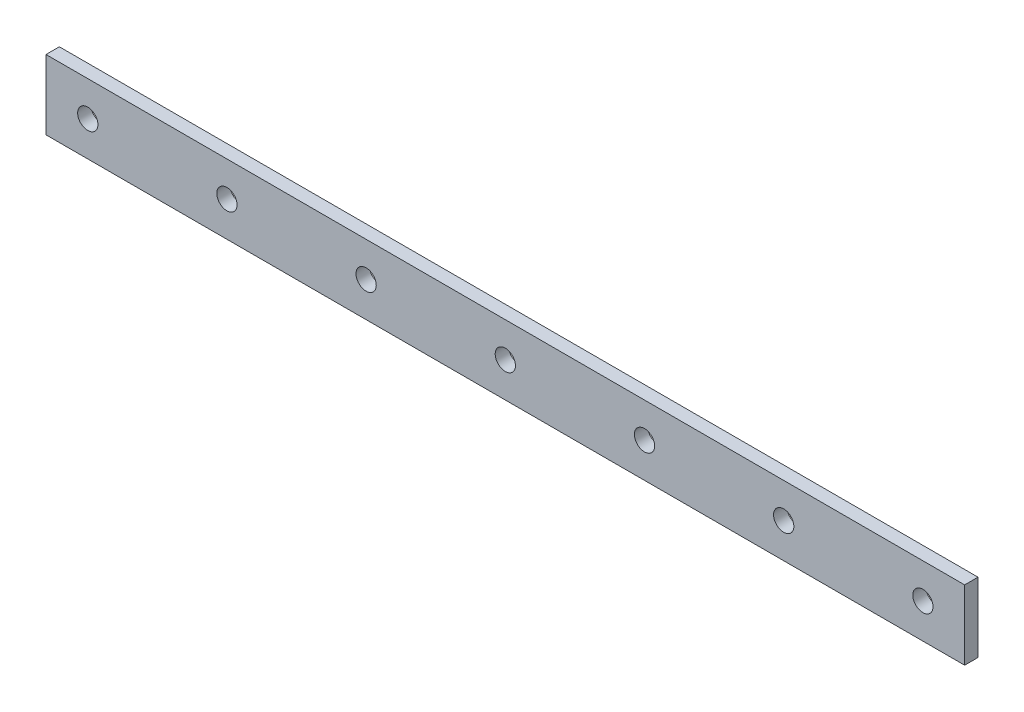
ISO-10303-21;
HEADER;
FILE_DESCRIPTION(('STEP AP214'),'2;1');
FILE_NAME('part.step','',(''),(''),'','','');
FILE_SCHEMA(('AUTOMOTIVE_DESIGN { 1 0 10303 214 1 1 1 1 }'));
ENDSEC;
DATA;
#1=APPLICATION_CONTEXT('core data for automotive mechanical design processes');
#2=APPLICATION_PROTOCOL_DEFINITION('international standard','automotive_design',2000,#1);
#3=PRODUCT_CONTEXT('',#1,'mechanical');
#4=PRODUCT('Part','Part','',(#3));
#5=PRODUCT_RELATED_PRODUCT_CATEGORY('part','',(#4));
#6=PRODUCT_DEFINITION_FORMATION('','',#4);
#7=PRODUCT_DEFINITION_CONTEXT('part definition',#1,'design');
#8=PRODUCT_DEFINITION('design','',#6,#7);
#9=PRODUCT_DEFINITION_SHAPE('','',#8);
#10=(LENGTH_UNIT() NAMED_UNIT(*) SI_UNIT(.MILLI.,.METRE.));
#11=(NAMED_UNIT(*) PLANE_ANGLE_UNIT() SI_UNIT($,.RADIAN.));
#12=(NAMED_UNIT(*) SI_UNIT($,.STERADIAN.) SOLID_ANGLE_UNIT());
#13=UNCERTAINTY_MEASURE_WITH_UNIT(LENGTH_MEASURE(1.E-05),#10,'distance_accuracy_value','');
#14=(GEOMETRIC_REPRESENTATION_CONTEXT(3) GLOBAL_UNCERTAINTY_ASSIGNED_CONTEXT((#13)) GLOBAL_UNIT_ASSIGNED_CONTEXT((#10,
#11,#12)) REPRESENTATION_CONTEXT('',''));
#15=CARTESIAN_POINT('',(0.,0.,0.));
#16=DIRECTION('',(0.,0.,1.));
#17=DIRECTION('',(1.,0.,0.));
#18=AXIS2_PLACEMENT_3D('',#15,#16,#17);
#19=CARTESIAN_POINT('',(-52.3875,-3.96875000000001,1.524));
#20=DIRECTION('',(1.,0.,0.));
#21=DIRECTION('',(0.,0.,-1.));
#22=AXIS2_PLACEMENT_3D('',#19,#20,#21);
#23=PLANE('',#22);
#24=DIRECTION('',(0.,-1.,0.));
#25=VECTOR('',#24,1.);
#26=CARTESIAN_POINT('',(-52.3875,-3.96875000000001,0.));
#27=LINE('',#26,#25);
#28=CARTESIAN_POINT('',(-52.3875,3.96874999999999,0.));
#29=VERTEX_POINT('',#28);
#30=CARTESIAN_POINT('',(-52.3875,-3.96875000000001,0.));
#31=VERTEX_POINT('',#30);
#32=EDGE_CURVE('E98',#29,#31,#27,.T.);
#33=ORIENTED_EDGE('',*,*,#32,.T.);
#34=DIRECTION('',(0.,0.,-1.));
#35=VECTOR('',#34,1.);
#36=CARTESIAN_POINT('',(-52.3875,-3.96875000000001,1.524));
#37=LINE('',#36,#35);
#38=CARTESIAN_POINT('',(-52.3875,-3.96875000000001,1.524));
#39=VERTEX_POINT('',#38);
#40=EDGE_CURVE('E11',#39,#31,#37,.T.);
#41=ORIENTED_EDGE('',*,*,#40,.F.);
#42=DIRECTION('',(0.,-1.,0.));
#43=VECTOR('',#42,1.);
#44=CARTESIAN_POINT('',(-52.3875,-3.96875000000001,1.524));
#45=LINE('',#44,#43);
#46=CARTESIAN_POINT('',(-52.3875,3.96874999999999,1.524));
#47=VERTEX_POINT('',#46);
#48=EDGE_CURVE('E86',#47,#39,#45,.T.);
#49=ORIENTED_EDGE('',*,*,#48,.F.);
#50=DIRECTION('',(0.,0.,-1.));
#51=VECTOR('',#50,1.);
#52=CARTESIAN_POINT('',(-52.3875,3.96874999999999,1.524));
#53=LINE('',#52,#51);
#54=EDGE_CURVE('E94',#47,#29,#53,.T.);
#55=ORIENTED_EDGE('',*,*,#54,.T.);
#56=EDGE_LOOP('',(#33,#41,#49,#55));
#57=FACE_BOUND('',#56,.T.);
#58=ADVANCED_FACE('F35',(#57),#23,.F.);
#59=CARTESIAN_POINT('',(52.3875,-3.96874999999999,1.524));
#60=DIRECTION('',(0.,1.,0.));
#61=DIRECTION('',(-1.,0.,0.));
#62=AXIS2_PLACEMENT_3D('',#59,#60,#61);
#63=PLANE('',#62);
#64=DIRECTION('',(1.,0.,0.));
#65=VECTOR('',#64,1.);
#66=CARTESIAN_POINT('',(52.3875,-3.96874999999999,0.));
#67=LINE('',#66,#65);
#68=CARTESIAN_POINT('',(52.3875,-3.96874999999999,0.));
#69=VERTEX_POINT('',#68);
#70=EDGE_CURVE('E90',#31,#69,#67,.T.);
#71=ORIENTED_EDGE('',*,*,#70,.T.);
#72=DIRECTION('',(0.,0.,-1.));
#73=VECTOR('',#72,1.);
#74=CARTESIAN_POINT('',(52.3875,-3.96874999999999,1.524));
#75=LINE('',#74,#73);
#76=CARTESIAN_POINT('',(52.3875,-3.96874999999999,1.524));
#77=VERTEX_POINT('',#76);
#78=EDGE_CURVE('E43',#77,#69,#75,.T.);
#79=ORIENTED_EDGE('',*,*,#78,.F.);
#80=DIRECTION('',(1.,0.,0.));
#81=VECTOR('',#80,1.);
#82=CARTESIAN_POINT('',(52.3875,-3.96874999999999,1.524));
#83=LINE('',#82,#81);
#84=EDGE_CURVE('E81',#39,#77,#83,.T.);
#85=ORIENTED_EDGE('',*,*,#84,.F.);
#86=ORIENTED_EDGE('',*,*,#40,.T.);
#87=EDGE_LOOP('',(#71,#79,#85,#86));
#88=FACE_BOUND('',#87,.T.);
#89=ADVANCED_FACE('F89',(#88),#63,.F.);
#90=CARTESIAN_POINT('',(52.3875,-3.96874999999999,1.524));
#91=DIRECTION('',(-1.,0.,0.));
#92=DIRECTION('',(0.,0.,1.));
#93=AXIS2_PLACEMENT_3D('',#90,#91,#92);
#94=PLANE('',#93);
#95=DIRECTION('',(0.,1.,0.));
#96=VECTOR('',#95,1.);
#97=CARTESIAN_POINT('',(52.3875,-3.96874999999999,0.));
#98=LINE('',#97,#96);
#99=CARTESIAN_POINT('',(52.3875,3.96875000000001,0.));
#100=VERTEX_POINT('',#99);
#101=EDGE_CURVE('E68',#69,#100,#98,.T.);
#102=ORIENTED_EDGE('',*,*,#101,.T.);
#103=DIRECTION('',(0.,0.,-1.));
#104=VECTOR('',#103,1.);
#105=CARTESIAN_POINT('',(52.3875,3.96875000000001,1.524));
#106=LINE('',#105,#104);
#107=CARTESIAN_POINT('',(52.3875,3.96875000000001,1.524));
#108=VERTEX_POINT('',#107);
#109=EDGE_CURVE('E91',#108,#100,#106,.T.);
#110=ORIENTED_EDGE('',*,*,#109,.F.);
#111=DIRECTION('',(0.,1.,0.));
#112=VECTOR('',#111,1.);
#113=CARTESIAN_POINT('',(52.3875,-3.96874999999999,1.524));
#114=LINE('',#113,#112);
#115=EDGE_CURVE('E84',#77,#108,#114,.T.);
#116=ORIENTED_EDGE('',*,*,#115,.F.);
#117=ORIENTED_EDGE('',*,*,#78,.T.);
#118=EDGE_LOOP('',(#102,#110,#116,#117));
#119=FACE_BOUND('',#118,.T.);
#120=ADVANCED_FACE('F92',(#119),#94,.F.);
#121=CARTESIAN_POINT('',(52.3875,3.96875000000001,1.524));
#122=DIRECTION('',(0.,-1.,0.));
#123=DIRECTION('',(1.,0.,0.));
#124=AXIS2_PLACEMENT_3D('',#121,#122,#123);
#125=PLANE('',#124);
#126=DIRECTION('',(-1.,0.,0.));
#127=VECTOR('',#126,1.);
#128=CARTESIAN_POINT('',(52.3875,3.96875000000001,0.));
#129=LINE('',#128,#127);
#130=EDGE_CURVE('E74',#100,#29,#129,.T.);
#131=ORIENTED_EDGE('',*,*,#130,.T.);
#132=ORIENTED_EDGE('',*,*,#54,.F.);
#133=DIRECTION('',(-1.,0.,0.));
#134=VECTOR('',#133,1.);
#135=CARTESIAN_POINT('',(52.3875,3.96875000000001,1.524));
#136=LINE('',#135,#134);
#137=EDGE_CURVE('E51',#108,#47,#136,.T.);
#138=ORIENTED_EDGE('',*,*,#137,.F.);
#139=ORIENTED_EDGE('',*,*,#109,.T.);
#140=EDGE_LOOP('',(#131,#132,#138,#139));
#141=FACE_BOUND('',#140,.T.);
#142=ADVANCED_FACE('F106',(#141),#125,.F.);
#143=CARTESIAN_POINT('',(0.,0.,1.524));
#144=DIRECTION('',(0.,0.,1.));
#145=DIRECTION('',(1.,0.,0.));
#146=AXIS2_PLACEMENT_3D('',#143,#144,#145);
#147=PLANE('',#146);
#148=CARTESIAN_POINT('',(47.625,0.,1.524));
#149=DIRECTION('',(0.,0.,1.));
#150=DIRECTION('',(1.,0.,0.));
#151=AXIS2_PLACEMENT_3D('',#148,#149,#150);
#152=CIRCLE('',#151,1.1557);
#153=CARTESIAN_POINT('',(48.7807,0.,1.524));
#154=VERTEX_POINT('',#153);
#155=EDGE_CURVE('E148',#154,#154,#152,.T.);
#156=ORIENTED_EDGE('',*,*,#155,.F.);
#157=EDGE_LOOP('',(#156));
#158=FACE_BOUND('',#157,.T.);
#159=CARTESIAN_POINT('',(31.75,0.,1.524));
#160=DIRECTION('',(0.,0.,1.));
#161=DIRECTION('',(1.,0.,0.));
#162=AXIS2_PLACEMENT_3D('',#159,#160,#161);
#163=CIRCLE('',#162,1.1557);
#164=CARTESIAN_POINT('',(32.9057,0.,1.524));
#165=VERTEX_POINT('',#164);
#166=EDGE_CURVE('E142',#165,#165,#163,.T.);
#167=ORIENTED_EDGE('',*,*,#166,.F.);
#168=EDGE_LOOP('',(#167));
#169=FACE_BOUND('',#168,.T.);
#170=CARTESIAN_POINT('',(15.875,0.,1.524));
#171=DIRECTION('',(0.,0.,1.));
#172=DIRECTION('',(1.,0.,0.));
#173=AXIS2_PLACEMENT_3D('',#170,#171,#172);
#174=CIRCLE('',#173,1.1557);
#175=CARTESIAN_POINT('',(17.0307,0.,1.524));
#176=VERTEX_POINT('',#175);
#177=EDGE_CURVE('E136',#176,#176,#174,.T.);
#178=ORIENTED_EDGE('',*,*,#177,.F.);
#179=EDGE_LOOP('',(#178));
#180=FACE_BOUND('',#179,.T.);
#181=CARTESIAN_POINT('',(-47.625,0.,1.524));
#182=DIRECTION('',(0.,0.,1.));
#183=DIRECTION('',(1.,0.,0.));
#184=AXIS2_PLACEMENT_3D('',#181,#182,#183);
#185=CIRCLE('',#184,1.1557);
#186=CARTESIAN_POINT('',(-46.4693,0.,1.524));
#187=VERTEX_POINT('',#186);
#188=EDGE_CURVE('E130',#187,#187,#185,.T.);
#189=ORIENTED_EDGE('',*,*,#188,.F.);
#190=EDGE_LOOP('',(#189));
#191=FACE_BOUND('',#190,.T.);
#192=CARTESIAN_POINT('',(-31.75,0.,1.524));
#193=DIRECTION('',(0.,0.,1.));
#194=DIRECTION('',(1.,0.,0.));
#195=AXIS2_PLACEMENT_3D('',#192,#193,#194);
#196=CIRCLE('',#195,1.1557);
#197=CARTESIAN_POINT('',(-30.5943,0.,1.524));
#198=VERTEX_POINT('',#197);
#199=EDGE_CURVE('E124',#198,#198,#196,.T.);
#200=ORIENTED_EDGE('',*,*,#199,.F.);
#201=EDGE_LOOP('',(#200));
#202=FACE_BOUND('',#201,.T.);
#203=CARTESIAN_POINT('',(-15.875,0.,1.524));
#204=DIRECTION('',(0.,0.,1.));
#205=DIRECTION('',(1.,0.,0.));
#206=AXIS2_PLACEMENT_3D('',#203,#204,#205);
#207=CIRCLE('',#206,1.1557);
#208=CARTESIAN_POINT('',(-14.7193,0.,1.524));
#209=VERTEX_POINT('',#208);
#210=EDGE_CURVE('E118',#209,#209,#207,.T.);
#211=ORIENTED_EDGE('',*,*,#210,.F.);
#212=EDGE_LOOP('',(#211));
#213=FACE_BOUND('',#212,.T.);
#214=CARTESIAN_POINT('',(0.,0.,1.524));
#215=DIRECTION('',(0.,0.,1.));
#216=DIRECTION('',(1.,0.,0.));
#217=AXIS2_PLACEMENT_3D('',#214,#215,#216);
#218=CIRCLE('',#217,1.1557);
#219=CARTESIAN_POINT('',(1.1557,0.,1.524));
#220=VERTEX_POINT('',#219);
#221=EDGE_CURVE('E112',#220,#220,#218,.T.);
#222=ORIENTED_EDGE('',*,*,#221,.F.);
#223=EDGE_LOOP('',(#222));
#224=FACE_BOUND('',#223,.T.);
#225=ORIENTED_EDGE('',*,*,#48,.T.);
#226=ORIENTED_EDGE('',*,*,#84,.T.);
#227=ORIENTED_EDGE('',*,*,#115,.T.);
#228=ORIENTED_EDGE('',*,*,#137,.T.);
#229=EDGE_LOOP('',(#225,#226,#227,#228));
#230=FACE_BOUND('',#229,.T.);
#231=ADVANCED_FACE('F82',(#158,#169,#180,#191,#202,#213,#224,#230),#147,.T.);
#232=CARTESIAN_POINT('',(0.,0.,0.));
#233=DIRECTION('',(0.,0.,1.));
#234=DIRECTION('',(1.,0.,0.));
#235=AXIS2_PLACEMENT_3D('',#232,#233,#234);
#236=PLANE('',#235);
#237=CARTESIAN_POINT('',(47.625,0.,0.));
#238=DIRECTION('',(0.,0.,1.));
#239=DIRECTION('',(1.,0.,0.));
#240=AXIS2_PLACEMENT_3D('',#237,#238,#239);
#241=CIRCLE('',#240,1.1557);
#242=CARTESIAN_POINT('',(48.7807,0.,0.));
#243=VERTEX_POINT('',#242);
#244=EDGE_CURVE('E145',#243,#243,#241,.T.);
#245=ORIENTED_EDGE('',*,*,#244,.T.);
#246=EDGE_LOOP('',(#245));
#247=FACE_BOUND('',#246,.T.);
#248=CARTESIAN_POINT('',(31.75,0.,0.));
#249=DIRECTION('',(0.,0.,1.));
#250=DIRECTION('',(1.,0.,0.));
#251=AXIS2_PLACEMENT_3D('',#248,#249,#250);
#252=CIRCLE('',#251,1.1557);
#253=CARTESIAN_POINT('',(32.9057,0.,0.));
#254=VERTEX_POINT('',#253);
#255=EDGE_CURVE('E139',#254,#254,#252,.T.);
#256=ORIENTED_EDGE('',*,*,#255,.T.);
#257=EDGE_LOOP('',(#256));
#258=FACE_BOUND('',#257,.T.);
#259=CARTESIAN_POINT('',(15.875,0.,0.));
#260=DIRECTION('',(0.,0.,1.));
#261=DIRECTION('',(1.,0.,0.));
#262=AXIS2_PLACEMENT_3D('',#259,#260,#261);
#263=CIRCLE('',#262,1.1557);
#264=CARTESIAN_POINT('',(17.0307,0.,0.));
#265=VERTEX_POINT('',#264);
#266=EDGE_CURVE('E133',#265,#265,#263,.T.);
#267=ORIENTED_EDGE('',*,*,#266,.T.);
#268=EDGE_LOOP('',(#267));
#269=FACE_BOUND('',#268,.T.);
#270=CARTESIAN_POINT('',(-47.625,0.,0.));
#271=DIRECTION('',(0.,0.,1.));
#272=DIRECTION('',(1.,0.,0.));
#273=AXIS2_PLACEMENT_3D('',#270,#271,#272);
#274=CIRCLE('',#273,1.1557);
#275=CARTESIAN_POINT('',(-46.4693,0.,0.));
#276=VERTEX_POINT('',#275);
#277=EDGE_CURVE('E127',#276,#276,#274,.T.);
#278=ORIENTED_EDGE('',*,*,#277,.T.);
#279=EDGE_LOOP('',(#278));
#280=FACE_BOUND('',#279,.T.);
#281=CARTESIAN_POINT('',(-31.75,0.,0.));
#282=DIRECTION('',(0.,0.,1.));
#283=DIRECTION('',(1.,0.,0.));
#284=AXIS2_PLACEMENT_3D('',#281,#282,#283);
#285=CIRCLE('',#284,1.1557);
#286=CARTESIAN_POINT('',(-30.5943,0.,0.));
#287=VERTEX_POINT('',#286);
#288=EDGE_CURVE('E121',#287,#287,#285,.T.);
#289=ORIENTED_EDGE('',*,*,#288,.T.);
#290=EDGE_LOOP('',(#289));
#291=FACE_BOUND('',#290,.T.);
#292=CARTESIAN_POINT('',(-15.875,0.,0.));
#293=DIRECTION('',(0.,0.,1.));
#294=DIRECTION('',(1.,0.,0.));
#295=AXIS2_PLACEMENT_3D('',#292,#293,#294);
#296=CIRCLE('',#295,1.1557);
#297=CARTESIAN_POINT('',(-14.7193,0.,0.));
#298=VERTEX_POINT('',#297);
#299=EDGE_CURVE('E115',#298,#298,#296,.T.);
#300=ORIENTED_EDGE('',*,*,#299,.T.);
#301=EDGE_LOOP('',(#300));
#302=FACE_BOUND('',#301,.T.);
#303=CARTESIAN_POINT('',(0.,0.,0.));
#304=DIRECTION('',(0.,0.,1.));
#305=DIRECTION('',(1.,0.,0.));
#306=AXIS2_PLACEMENT_3D('',#303,#304,#305);
#307=CIRCLE('',#306,1.1557);
#308=CARTESIAN_POINT('',(1.1557,0.,0.));
#309=VERTEX_POINT('',#308);
#310=EDGE_CURVE('E101',#309,#309,#307,.T.);
#311=ORIENTED_EDGE('',*,*,#310,.T.);
#312=EDGE_LOOP('',(#311));
#313=FACE_BOUND('',#312,.T.);
#314=ORIENTED_EDGE('',*,*,#32,.F.);
#315=ORIENTED_EDGE('',*,*,#130,.F.);
#316=ORIENTED_EDGE('',*,*,#101,.F.);
#317=ORIENTED_EDGE('',*,*,#70,.F.);
#318=EDGE_LOOP('',(#314,#315,#316,#317));
#319=FACE_BOUND('',#318,.T.);
#320=ADVANCED_FACE('F109',(#247,#258,#269,#280,#291,#302,#313,#319),#236,.F.);
#321=CARTESIAN_POINT('',(0.,0.,0.));
#322=DIRECTION('',(0.,0.,1.));
#323=DIRECTION('',(1.,0.,0.));
#324=AXIS2_PLACEMENT_3D('',#321,#322,#323);
#325=CYLINDRICAL_SURFACE('',#324,1.1557);
#326=CARTESIAN_POINT('',(1.1557,0.,0.));
#327=CARTESIAN_POINT('',(1.1557,0.,0.015875));
#328=CARTESIAN_POINT('',(1.1557,0.,0.03175));
#329=CARTESIAN_POINT('',(1.1557,0.,0.0635));
#330=CARTESIAN_POINT('',(1.1557,0.,0.079375));
#331=CARTESIAN_POINT('',(1.1557,0.,0.111125));
#332=CARTESIAN_POINT('',(1.1557,0.,0.127));
#333=CARTESIAN_POINT('',(1.1557,0.,0.15875));
#334=CARTESIAN_POINT('',(1.1557,0.,0.174625));
#335=CARTESIAN_POINT('',(1.1557,0.,0.206375));
#336=CARTESIAN_POINT('',(1.1557,0.,0.22225));
#337=CARTESIAN_POINT('',(1.1557,0.,0.254));
#338=CARTESIAN_POINT('',(1.1557,0.,0.269875));
#339=CARTESIAN_POINT('',(1.1557,0.,0.301625));
#340=CARTESIAN_POINT('',(1.1557,0.,0.3175));
#341=CARTESIAN_POINT('',(1.1557,0.,0.34925));
#342=CARTESIAN_POINT('',(1.1557,0.,0.365125));
#343=CARTESIAN_POINT('',(1.1557,0.,0.396875));
#344=CARTESIAN_POINT('',(1.1557,0.,0.41275));
#345=CARTESIAN_POINT('',(1.1557,0.,0.4445));
#346=CARTESIAN_POINT('',(1.1557,0.,0.460375));
#347=CARTESIAN_POINT('',(1.1557,0.,0.492125));
#348=CARTESIAN_POINT('',(1.1557,0.,0.508));
#349=CARTESIAN_POINT('',(1.1557,0.,0.53975));
#350=CARTESIAN_POINT('',(1.1557,0.,0.555625));
#351=CARTESIAN_POINT('',(1.1557,0.,0.587375));
#352=CARTESIAN_POINT('',(1.1557,0.,0.60325));
#353=CARTESIAN_POINT('',(1.1557,0.,0.635));
#354=CARTESIAN_POINT('',(1.1557,0.,0.650875));
#355=CARTESIAN_POINT('',(1.1557,0.,0.682625));
#356=CARTESIAN_POINT('',(1.1557,0.,0.6985));
#357=CARTESIAN_POINT('',(1.1557,0.,0.73025));
#358=CARTESIAN_POINT('',(1.1557,0.,0.746125));
#359=CARTESIAN_POINT('',(1.1557,0.,0.777875));
#360=CARTESIAN_POINT('',(1.1557,0.,0.79375));
#361=CARTESIAN_POINT('',(1.1557,0.,0.8255));
#362=CARTESIAN_POINT('',(1.1557,0.,0.841375));
#363=CARTESIAN_POINT('',(1.1557,0.,0.873125));
#364=CARTESIAN_POINT('',(1.1557,0.,0.889));
#365=CARTESIAN_POINT('',(1.1557,0.,0.92075));
#366=CARTESIAN_POINT('',(1.1557,0.,0.936625));
#367=CARTESIAN_POINT('',(1.1557,0.,0.968375));
#368=CARTESIAN_POINT('',(1.1557,0.,0.98425));
#369=CARTESIAN_POINT('',(1.1557,0.,1.016));
#370=CARTESIAN_POINT('',(1.1557,0.,1.031875));
#371=CARTESIAN_POINT('',(1.1557,0.,1.063625));
#372=CARTESIAN_POINT('',(1.1557,0.,1.0795));
#373=CARTESIAN_POINT('',(1.1557,0.,1.11125));
#374=CARTESIAN_POINT('',(1.1557,0.,1.127125));
#375=CARTESIAN_POINT('',(1.1557,0.,1.158875));
#376=CARTESIAN_POINT('',(1.1557,0.,1.17475));
#377=CARTESIAN_POINT('',(1.1557,0.,1.2065));
#378=CARTESIAN_POINT('',(1.1557,0.,1.222375));
#379=CARTESIAN_POINT('',(1.1557,0.,1.254125));
#380=CARTESIAN_POINT('',(1.1557,0.,1.27));
#381=CARTESIAN_POINT('',(1.1557,0.,1.30175));
#382=CARTESIAN_POINT('',(1.1557,0.,1.317625));
#383=CARTESIAN_POINT('',(1.1557,0.,1.349375));
#384=CARTESIAN_POINT('',(1.1557,0.,1.36525));
#385=CARTESIAN_POINT('',(1.1557,0.,1.397));
#386=CARTESIAN_POINT('',(1.1557,0.,1.412875));
#387=CARTESIAN_POINT('',(1.1557,0.,1.444625));
#388=CARTESIAN_POINT('',(1.1557,0.,1.4605));
#389=CARTESIAN_POINT('',(1.1557,0.,1.49225));
#390=CARTESIAN_POINT('',(1.1557,0.,1.508125));
#391=CARTESIAN_POINT('',(1.1557,0.,1.524));
#392=B_SPLINE_CURVE_WITH_KNOTS('',3,(#326,#327,#328,#329,#330,#331,#332,#333,#334,#335,#336,
#337,#338,#339,#340,#341,#342,#343,#344,#345,#346,#347,#348,#349,#350,#351,#352,#353,#354,#355,
#356,#357,#358,#359,#360,#361,#362,#363,#364,#365,#366,#367,#368,#369,#370,#371,#372,#373,#374,
#375,#376,#377,#378,#379,#380,#381,#382,#383,#384,#385,#386,#387,#388,#389,#390,#391),
.UNSPECIFIED.,.F.,.F.,(4,2,2,2,2,2,2,2,2,2,2,2,2,2,2,2,2,2,2,2,2,2,2,2,2,2,2,2,2,2,2,2,4),(0.,
0.047625,0.09525,0.142875,0.1905,0.238125,0.28575,0.333375,0.381,0.428625,0.47625,0.523875,
0.5715,0.619125,0.66675,0.714375,0.762,0.809625,0.85725,0.904875,0.9525,1.000125,1.04775,
1.095375,1.143,1.190625,1.23825,1.285875,1.3335,1.381125,1.42875,1.476375,1.524),.UNSPECIFIED.);
#393=EDGE_CURVE('BSEAM178',#309,#220,#392,.T.);
#394=ORIENTED_EDGE('',*,*,#310,.F.);
#395=ORIENTED_EDGE('',*,*,#221,.T.);
#396=ORIENTED_EDGE('',*,*,#393,.T.);
#397=ORIENTED_EDGE('',*,*,#393,.F.);
#398=EDGE_LOOP('',(#394,#396,#395,#397));
#399=FACE_BOUND('',#398,.T.);
#400=ADVANCED_FACE('F178',(#399),#325,.F.);
#401=CARTESIAN_POINT('',(-15.875,0.,0.));
#402=DIRECTION('',(0.,0.,1.));
#403=DIRECTION('',(1.,0.,0.));
#404=AXIS2_PLACEMENT_3D('',#401,#402,#403);
#405=CYLINDRICAL_SURFACE('',#404,1.1557);
#406=CARTESIAN_POINT('',(-14.7193,0.,0.));
#407=CARTESIAN_POINT('',(-14.7193,0.,0.015875));
#408=CARTESIAN_POINT('',(-14.7193,0.,0.03175));
#409=CARTESIAN_POINT('',(-14.7193,0.,0.0635));
#410=CARTESIAN_POINT('',(-14.7193,0.,0.079375));
#411=CARTESIAN_POINT('',(-14.7193,0.,0.111125));
#412=CARTESIAN_POINT('',(-14.7193,0.,0.127));
#413=CARTESIAN_POINT('',(-14.7193,0.,0.15875));
#414=CARTESIAN_POINT('',(-14.7193,0.,0.174625));
#415=CARTESIAN_POINT('',(-14.7193,0.,0.206375));
#416=CARTESIAN_POINT('',(-14.7193,0.,0.22225));
#417=CARTESIAN_POINT('',(-14.7193,0.,0.254));
#418=CARTESIAN_POINT('',(-14.7193,0.,0.269875));
#419=CARTESIAN_POINT('',(-14.7193,0.,0.301625));
#420=CARTESIAN_POINT('',(-14.7193,0.,0.3175));
#421=CARTESIAN_POINT('',(-14.7193,0.,0.34925));
#422=CARTESIAN_POINT('',(-14.7193,0.,0.365125));
#423=CARTESIAN_POINT('',(-14.7193,0.,0.396875));
#424=CARTESIAN_POINT('',(-14.7193,0.,0.41275));
#425=CARTESIAN_POINT('',(-14.7193,0.,0.4445));
#426=CARTESIAN_POINT('',(-14.7193,0.,0.460375));
#427=CARTESIAN_POINT('',(-14.7193,0.,0.492125));
#428=CARTESIAN_POINT('',(-14.7193,0.,0.508));
#429=CARTESIAN_POINT('',(-14.7193,0.,0.53975));
#430=CARTESIAN_POINT('',(-14.7193,0.,0.555625));
#431=CARTESIAN_POINT('',(-14.7193,0.,0.587375));
#432=CARTESIAN_POINT('',(-14.7193,0.,0.60325));
#433=CARTESIAN_POINT('',(-14.7193,0.,0.635));
#434=CARTESIAN_POINT('',(-14.7193,0.,0.650875));
#435=CARTESIAN_POINT('',(-14.7193,0.,0.682625));
#436=CARTESIAN_POINT('',(-14.7193,0.,0.6985));
#437=CARTESIAN_POINT('',(-14.7193,0.,0.73025));
#438=CARTESIAN_POINT('',(-14.7193,0.,0.746125));
#439=CARTESIAN_POINT('',(-14.7193,0.,0.777875));
#440=CARTESIAN_POINT('',(-14.7193,0.,0.79375));
#441=CARTESIAN_POINT('',(-14.7193,0.,0.8255));
#442=CARTESIAN_POINT('',(-14.7193,0.,0.841375));
#443=CARTESIAN_POINT('',(-14.7193,0.,0.873125));
#444=CARTESIAN_POINT('',(-14.7193,0.,0.889));
#445=CARTESIAN_POINT('',(-14.7193,0.,0.92075));
#446=CARTESIAN_POINT('',(-14.7193,0.,0.936625));
#447=CARTESIAN_POINT('',(-14.7193,0.,0.968375));
#448=CARTESIAN_POINT('',(-14.7193,0.,0.98425));
#449=CARTESIAN_POINT('',(-14.7193,0.,1.016));
#450=CARTESIAN_POINT('',(-14.7193,0.,1.031875));
#451=CARTESIAN_POINT('',(-14.7193,0.,1.063625));
#452=CARTESIAN_POINT('',(-14.7193,0.,1.0795));
#453=CARTESIAN_POINT('',(-14.7193,0.,1.11125));
#454=CARTESIAN_POINT('',(-14.7193,0.,1.127125));
#455=CARTESIAN_POINT('',(-14.7193,0.,1.158875));
#456=CARTESIAN_POINT('',(-14.7193,0.,1.17475));
#457=CARTESIAN_POINT('',(-14.7193,0.,1.2065));
#458=CARTESIAN_POINT('',(-14.7193,0.,1.222375));
#459=CARTESIAN_POINT('',(-14.7193,0.,1.254125));
#460=CARTESIAN_POINT('',(-14.7193,0.,1.27));
#461=CARTESIAN_POINT('',(-14.7193,0.,1.30175));
#462=CARTESIAN_POINT('',(-14.7193,0.,1.317625));
#463=CARTESIAN_POINT('',(-14.7193,0.,1.349375));
#464=CARTESIAN_POINT('',(-14.7193,0.,1.36525));
#465=CARTESIAN_POINT('',(-14.7193,0.,1.397));
#466=CARTESIAN_POINT('',(-14.7193,0.,1.412875));
#467=CARTESIAN_POINT('',(-14.7193,0.,1.444625));
#468=CARTESIAN_POINT('',(-14.7193,0.,1.4605));
#469=CARTESIAN_POINT('',(-14.7193,0.,1.49225));
#470=CARTESIAN_POINT('',(-14.7193,0.,1.508125));
#471=CARTESIAN_POINT('',(-14.7193,0.,1.524));
#472=B_SPLINE_CURVE_WITH_KNOTS('',3,(#406,#407,#408,#409,#410,#411,#412,#413,#414,#415,#416,
#417,#418,#419,#420,#421,#422,#423,#424,#425,#426,#427,#428,#429,#430,#431,#432,#433,#434,#435,
#436,#437,#438,#439,#440,#441,#442,#443,#444,#445,#446,#447,#448,#449,#450,#451,#452,#453,#454,
#455,#456,#457,#458,#459,#460,#461,#462,#463,#464,#465,#466,#467,#468,#469,#470,#471),
.UNSPECIFIED.,.F.,.F.,(4,2,2,2,2,2,2,2,2,2,2,2,2,2,2,2,2,2,2,2,2,2,2,2,2,2,2,2,2,2,2,2,4),(0.,
0.047625,0.09525,0.142875,0.1905,0.238125,0.28575,0.333375,0.381,0.428625,0.47625,0.523875,
0.5715,0.619125,0.66675,0.714375,0.762,0.809625,0.85725,0.904875,0.9525,1.000125,1.04775,
1.095375,1.143,1.190625,1.23825,1.285875,1.3335,1.381125,1.42875,1.476375,1.524),.UNSPECIFIED.);
#473=EDGE_CURVE('BSEAM180',#298,#209,#472,.T.);
#474=ORIENTED_EDGE('',*,*,#299,.F.);
#475=ORIENTED_EDGE('',*,*,#210,.T.);
#476=ORIENTED_EDGE('',*,*,#473,.T.);
#477=ORIENTED_EDGE('',*,*,#473,.F.);
#478=EDGE_LOOP('',(#474,#476,#475,#477));
#479=FACE_BOUND('',#478,.T.);
#480=ADVANCED_FACE('F180',(#479),#405,.F.);
#481=CARTESIAN_POINT('',(-31.75,0.,0.));
#482=DIRECTION('',(0.,0.,1.));
#483=DIRECTION('',(1.,0.,0.));
#484=AXIS2_PLACEMENT_3D('',#481,#482,#483);
#485=CYLINDRICAL_SURFACE('',#484,1.1557);
#486=CARTESIAN_POINT('',(-30.5943,0.,0.));
#487=CARTESIAN_POINT('',(-30.5943,0.,0.015875));
#488=CARTESIAN_POINT('',(-30.5943,0.,0.03175));
#489=CARTESIAN_POINT('',(-30.5943,0.,0.0635));
#490=CARTESIAN_POINT('',(-30.5943,0.,0.079375));
#491=CARTESIAN_POINT('',(-30.5943,0.,0.111125));
#492=CARTESIAN_POINT('',(-30.5943,0.,0.127));
#493=CARTESIAN_POINT('',(-30.5943,0.,0.15875));
#494=CARTESIAN_POINT('',(-30.5943,0.,0.174625));
#495=CARTESIAN_POINT('',(-30.5943,0.,0.206375));
#496=CARTESIAN_POINT('',(-30.5943,0.,0.22225));
#497=CARTESIAN_POINT('',(-30.5943,0.,0.254));
#498=CARTESIAN_POINT('',(-30.5943,0.,0.269875));
#499=CARTESIAN_POINT('',(-30.5943,0.,0.301625));
#500=CARTESIAN_POINT('',(-30.5943,0.,0.3175));
#501=CARTESIAN_POINT('',(-30.5943,0.,0.34925));
#502=CARTESIAN_POINT('',(-30.5943,0.,0.365125));
#503=CARTESIAN_POINT('',(-30.5943,0.,0.396875));
#504=CARTESIAN_POINT('',(-30.5943,0.,0.41275));
#505=CARTESIAN_POINT('',(-30.5943,0.,0.4445));
#506=CARTESIAN_POINT('',(-30.5943,0.,0.460375));
#507=CARTESIAN_POINT('',(-30.5943,0.,0.492125));
#508=CARTESIAN_POINT('',(-30.5943,0.,0.508));
#509=CARTESIAN_POINT('',(-30.5943,0.,0.53975));
#510=CARTESIAN_POINT('',(-30.5943,0.,0.555625));
#511=CARTESIAN_POINT('',(-30.5943,0.,0.587375));
#512=CARTESIAN_POINT('',(-30.5943,0.,0.60325));
#513=CARTESIAN_POINT('',(-30.5943,0.,0.635));
#514=CARTESIAN_POINT('',(-30.5943,0.,0.650875));
#515=CARTESIAN_POINT('',(-30.5943,0.,0.682625));
#516=CARTESIAN_POINT('',(-30.5943,0.,0.6985));
#517=CARTESIAN_POINT('',(-30.5943,0.,0.73025));
#518=CARTESIAN_POINT('',(-30.5943,0.,0.746125));
#519=CARTESIAN_POINT('',(-30.5943,0.,0.777875));
#520=CARTESIAN_POINT('',(-30.5943,0.,0.79375));
#521=CARTESIAN_POINT('',(-30.5943,0.,0.8255));
#522=CARTESIAN_POINT('',(-30.5943,0.,0.841375));
#523=CARTESIAN_POINT('',(-30.5943,0.,0.873125));
#524=CARTESIAN_POINT('',(-30.5943,0.,0.889));
#525=CARTESIAN_POINT('',(-30.5943,0.,0.92075));
#526=CARTESIAN_POINT('',(-30.5943,0.,0.936625));
#527=CARTESIAN_POINT('',(-30.5943,0.,0.968375));
#528=CARTESIAN_POINT('',(-30.5943,0.,0.98425));
#529=CARTESIAN_POINT('',(-30.5943,0.,1.016));
#530=CARTESIAN_POINT('',(-30.5943,0.,1.031875));
#531=CARTESIAN_POINT('',(-30.5943,0.,1.063625));
#532=CARTESIAN_POINT('',(-30.5943,0.,1.0795));
#533=CARTESIAN_POINT('',(-30.5943,0.,1.11125));
#534=CARTESIAN_POINT('',(-30.5943,0.,1.127125));
#535=CARTESIAN_POINT('',(-30.5943,0.,1.158875));
#536=CARTESIAN_POINT('',(-30.5943,0.,1.17475));
#537=CARTESIAN_POINT('',(-30.5943,0.,1.2065));
#538=CARTESIAN_POINT('',(-30.5943,0.,1.222375));
#539=CARTESIAN_POINT('',(-30.5943,0.,1.254125));
#540=CARTESIAN_POINT('',(-30.5943,0.,1.27));
#541=CARTESIAN_POINT('',(-30.5943,0.,1.30175));
#542=CARTESIAN_POINT('',(-30.5943,0.,1.317625));
#543=CARTESIAN_POINT('',(-30.5943,0.,1.349375));
#544=CARTESIAN_POINT('',(-30.5943,0.,1.36525));
#545=CARTESIAN_POINT('',(-30.5943,0.,1.397));
#546=CARTESIAN_POINT('',(-30.5943,0.,1.412875));
#547=CARTESIAN_POINT('',(-30.5943,0.,1.444625));
#548=CARTESIAN_POINT('',(-30.5943,0.,1.4605));
#549=CARTESIAN_POINT('',(-30.5943,0.,1.49225));
#550=CARTESIAN_POINT('',(-30.5943,0.,1.508125));
#551=CARTESIAN_POINT('',(-30.5943,0.,1.524));
#552=B_SPLINE_CURVE_WITH_KNOTS('',3,(#486,#487,#488,#489,#490,#491,#492,#493,#494,#495,#496,
#497,#498,#499,#500,#501,#502,#503,#504,#505,#506,#507,#508,#509,#510,#511,#512,#513,#514,#515,
#516,#517,#518,#519,#520,#521,#522,#523,#524,#525,#526,#527,#528,#529,#530,#531,#532,#533,#534,
#535,#536,#537,#538,#539,#540,#541,#542,#543,#544,#545,#546,#547,#548,#549,#550,#551),
.UNSPECIFIED.,.F.,.F.,(4,2,2,2,2,2,2,2,2,2,2,2,2,2,2,2,2,2,2,2,2,2,2,2,2,2,2,2,2,2,2,2,4),(0.,
0.047625,0.09525,0.142875,0.1905,0.238125,0.28575,0.333375,0.381,0.428625,0.47625,0.523875,
0.5715,0.619125,0.66675,0.714375,0.762,0.809625,0.85725,0.904875,0.9525,1.000125,1.04775,
1.095375,1.143,1.190625,1.23825,1.285875,1.3335,1.381125,1.42875,1.476375,1.524),.UNSPECIFIED.);
#553=EDGE_CURVE('BSEAM187',#287,#198,#552,.T.);
#554=ORIENTED_EDGE('',*,*,#288,.F.);
#555=ORIENTED_EDGE('',*,*,#199,.T.);
#556=ORIENTED_EDGE('',*,*,#553,.T.);
#557=ORIENTED_EDGE('',*,*,#553,.F.);
#558=EDGE_LOOP('',(#554,#556,#555,#557));
#559=FACE_BOUND('',#558,.T.);
#560=ADVANCED_FACE('F187',(#559),#485,.F.);
#561=CARTESIAN_POINT('',(-47.625,0.,0.));
#562=DIRECTION('',(0.,0.,1.));
#563=DIRECTION('',(1.,0.,0.));
#564=AXIS2_PLACEMENT_3D('',#561,#562,#563);
#565=CYLINDRICAL_SURFACE('',#564,1.1557);
#566=CARTESIAN_POINT('',(-46.4693,0.,0.));
#567=CARTESIAN_POINT('',(-46.4693,0.,0.015875));
#568=CARTESIAN_POINT('',(-46.4693,0.,0.03175));
#569=CARTESIAN_POINT('',(-46.4693,0.,0.0635));
#570=CARTESIAN_POINT('',(-46.4693,0.,0.079375));
#571=CARTESIAN_POINT('',(-46.4693,0.,0.111125));
#572=CARTESIAN_POINT('',(-46.4693,0.,0.127));
#573=CARTESIAN_POINT('',(-46.4693,0.,0.15875));
#574=CARTESIAN_POINT('',(-46.4693,0.,0.174625));
#575=CARTESIAN_POINT('',(-46.4693,0.,0.206375));
#576=CARTESIAN_POINT('',(-46.4693,0.,0.22225));
#577=CARTESIAN_POINT('',(-46.4693,0.,0.254));
#578=CARTESIAN_POINT('',(-46.4693,0.,0.269875));
#579=CARTESIAN_POINT('',(-46.4693,0.,0.301625));
#580=CARTESIAN_POINT('',(-46.4693,0.,0.3175));
#581=CARTESIAN_POINT('',(-46.4693,0.,0.34925));
#582=CARTESIAN_POINT('',(-46.4693,0.,0.365125));
#583=CARTESIAN_POINT('',(-46.4693,0.,0.396875));
#584=CARTESIAN_POINT('',(-46.4693,0.,0.41275));
#585=CARTESIAN_POINT('',(-46.4693,0.,0.4445));
#586=CARTESIAN_POINT('',(-46.4693,0.,0.460375));
#587=CARTESIAN_POINT('',(-46.4693,0.,0.492125));
#588=CARTESIAN_POINT('',(-46.4693,0.,0.508));
#589=CARTESIAN_POINT('',(-46.4693,0.,0.53975));
#590=CARTESIAN_POINT('',(-46.4693,0.,0.555625));
#591=CARTESIAN_POINT('',(-46.4693,0.,0.587375));
#592=CARTESIAN_POINT('',(-46.4693,0.,0.60325));
#593=CARTESIAN_POINT('',(-46.4693,0.,0.635));
#594=CARTESIAN_POINT('',(-46.4693,0.,0.650875));
#595=CARTESIAN_POINT('',(-46.4693,0.,0.682625));
#596=CARTESIAN_POINT('',(-46.4693,0.,0.6985));
#597=CARTESIAN_POINT('',(-46.4693,0.,0.73025));
#598=CARTESIAN_POINT('',(-46.4693,0.,0.746125));
#599=CARTESIAN_POINT('',(-46.4693,0.,0.777875));
#600=CARTESIAN_POINT('',(-46.4693,0.,0.79375));
#601=CARTESIAN_POINT('',(-46.4693,0.,0.8255));
#602=CARTESIAN_POINT('',(-46.4693,0.,0.841375));
#603=CARTESIAN_POINT('',(-46.4693,0.,0.873125));
#604=CARTESIAN_POINT('',(-46.4693,0.,0.889));
#605=CARTESIAN_POINT('',(-46.4693,0.,0.92075));
#606=CARTESIAN_POINT('',(-46.4693,0.,0.936625));
#607=CARTESIAN_POINT('',(-46.4693,0.,0.968375));
#608=CARTESIAN_POINT('',(-46.4693,0.,0.98425));
#609=CARTESIAN_POINT('',(-46.4693,0.,1.016));
#610=CARTESIAN_POINT('',(-46.4693,0.,1.031875));
#611=CARTESIAN_POINT('',(-46.4693,0.,1.063625));
#612=CARTESIAN_POINT('',(-46.4693,0.,1.0795));
#613=CARTESIAN_POINT('',(-46.4693,0.,1.11125));
#614=CARTESIAN_POINT('',(-46.4693,0.,1.127125));
#615=CARTESIAN_POINT('',(-46.4693,0.,1.158875));
#616=CARTESIAN_POINT('',(-46.4693,0.,1.17475));
#617=CARTESIAN_POINT('',(-46.4693,0.,1.2065));
#618=CARTESIAN_POINT('',(-46.4693,0.,1.222375));
#619=CARTESIAN_POINT('',(-46.4693,0.,1.254125));
#620=CARTESIAN_POINT('',(-46.4693,0.,1.27));
#621=CARTESIAN_POINT('',(-46.4693,0.,1.30175));
#622=CARTESIAN_POINT('',(-46.4693,0.,1.317625));
#623=CARTESIAN_POINT('',(-46.4693,0.,1.349375));
#624=CARTESIAN_POINT('',(-46.4693,0.,1.36525));
#625=CARTESIAN_POINT('',(-46.4693,0.,1.397));
#626=CARTESIAN_POINT('',(-46.4693,0.,1.412875));
#627=CARTESIAN_POINT('',(-46.4693,0.,1.444625));
#628=CARTESIAN_POINT('',(-46.4693,0.,1.4605));
#629=CARTESIAN_POINT('',(-46.4693,0.,1.49225));
#630=CARTESIAN_POINT('',(-46.4693,0.,1.508125));
#631=CARTESIAN_POINT('',(-46.4693,0.,1.524));
#632=B_SPLINE_CURVE_WITH_KNOTS('',3,(#566,#567,#568,#569,#570,#571,#572,#573,#574,#575,#576,
#577,#578,#579,#580,#581,#582,#583,#584,#585,#586,#587,#588,#589,#590,#591,#592,#593,#594,#595,
#596,#597,#598,#599,#600,#601,#602,#603,#604,#605,#606,#607,#608,#609,#610,#611,#612,#613,#614,
#615,#616,#617,#618,#619,#620,#621,#622,#623,#624,#625,#626,#627,#628,#629,#630,#631),
.UNSPECIFIED.,.F.,.F.,(4,2,2,2,2,2,2,2,2,2,2,2,2,2,2,2,2,2,2,2,2,2,2,2,2,2,2,2,2,2,2,2,4),(0.,
0.047625,0.09525,0.142875,0.1905,0.238125,0.28575,0.333375,0.381,0.428625,0.47625,0.523875,
0.5715,0.619125,0.66675,0.714375,0.762,0.809625,0.85725,0.904875,0.9525,1.000125,1.04775,
1.095375,1.143,1.190625,1.23825,1.285875,1.3335,1.381125,1.42875,1.476375,1.524),.UNSPECIFIED.);
#633=EDGE_CURVE('BSEAM230',#276,#187,#632,.T.);
#634=ORIENTED_EDGE('',*,*,#277,.F.);
#635=ORIENTED_EDGE('',*,*,#188,.T.);
#636=ORIENTED_EDGE('',*,*,#633,.T.);
#637=ORIENTED_EDGE('',*,*,#633,.F.);
#638=EDGE_LOOP('',(#634,#636,#635,#637));
#639=FACE_BOUND('',#638,.T.);
#640=ADVANCED_FACE('F230',(#639),#565,.F.);
#641=CARTESIAN_POINT('',(15.875,0.,0.));
#642=DIRECTION('',(0.,0.,1.));
#643=DIRECTION('',(1.,0.,0.));
#644=AXIS2_PLACEMENT_3D('',#641,#642,#643);
#645=CYLINDRICAL_SURFACE('',#644,1.1557);
#646=CARTESIAN_POINT('',(17.0307,0.,0.));
#647=CARTESIAN_POINT('',(17.0307,0.,0.015875));
#648=CARTESIAN_POINT('',(17.0307,0.,0.03175));
#649=CARTESIAN_POINT('',(17.0307,0.,0.0635));
#650=CARTESIAN_POINT('',(17.0307,0.,0.079375));
#651=CARTESIAN_POINT('',(17.0307,0.,0.111125));
#652=CARTESIAN_POINT('',(17.0307,0.,0.127));
#653=CARTESIAN_POINT('',(17.0307,0.,0.15875));
#654=CARTESIAN_POINT('',(17.0307,0.,0.174625));
#655=CARTESIAN_POINT('',(17.0307,0.,0.206375));
#656=CARTESIAN_POINT('',(17.0307,0.,0.22225));
#657=CARTESIAN_POINT('',(17.0307,0.,0.254));
#658=CARTESIAN_POINT('',(17.0307,0.,0.269875));
#659=CARTESIAN_POINT('',(17.0307,0.,0.301625));
#660=CARTESIAN_POINT('',(17.0307,0.,0.3175));
#661=CARTESIAN_POINT('',(17.0307,0.,0.34925));
#662=CARTESIAN_POINT('',(17.0307,0.,0.365125));
#663=CARTESIAN_POINT('',(17.0307,0.,0.396875));
#664=CARTESIAN_POINT('',(17.0307,0.,0.41275));
#665=CARTESIAN_POINT('',(17.0307,0.,0.4445));
#666=CARTESIAN_POINT('',(17.0307,0.,0.460375));
#667=CARTESIAN_POINT('',(17.0307,0.,0.492125));
#668=CARTESIAN_POINT('',(17.0307,0.,0.508));
#669=CARTESIAN_POINT('',(17.0307,0.,0.53975));
#670=CARTESIAN_POINT('',(17.0307,0.,0.555625));
#671=CARTESIAN_POINT('',(17.0307,0.,0.587375));
#672=CARTESIAN_POINT('',(17.0307,0.,0.60325));
#673=CARTESIAN_POINT('',(17.0307,0.,0.635));
#674=CARTESIAN_POINT('',(17.0307,0.,0.650875));
#675=CARTESIAN_POINT('',(17.0307,0.,0.682625));
#676=CARTESIAN_POINT('',(17.0307,0.,0.6985));
#677=CARTESIAN_POINT('',(17.0307,0.,0.73025));
#678=CARTESIAN_POINT('',(17.0307,0.,0.746125));
#679=CARTESIAN_POINT('',(17.0307,0.,0.777875));
#680=CARTESIAN_POINT('',(17.0307,0.,0.79375));
#681=CARTESIAN_POINT('',(17.0307,0.,0.8255));
#682=CARTESIAN_POINT('',(17.0307,0.,0.841375));
#683=CARTESIAN_POINT('',(17.0307,0.,0.873125));
#684=CARTESIAN_POINT('',(17.0307,0.,0.889));
#685=CARTESIAN_POINT('',(17.0307,0.,0.92075));
#686=CARTESIAN_POINT('',(17.0307,0.,0.936625));
#687=CARTESIAN_POINT('',(17.0307,0.,0.968375));
#688=CARTESIAN_POINT('',(17.0307,0.,0.98425));
#689=CARTESIAN_POINT('',(17.0307,0.,1.016));
#690=CARTESIAN_POINT('',(17.0307,0.,1.031875));
#691=CARTESIAN_POINT('',(17.0307,0.,1.063625));
#692=CARTESIAN_POINT('',(17.0307,0.,1.0795));
#693=CARTESIAN_POINT('',(17.0307,0.,1.11125));
#694=CARTESIAN_POINT('',(17.0307,0.,1.127125));
#695=CARTESIAN_POINT('',(17.0307,0.,1.158875));
#696=CARTESIAN_POINT('',(17.0307,0.,1.17475));
#697=CARTESIAN_POINT('',(17.0307,0.,1.2065));
#698=CARTESIAN_POINT('',(17.0307,0.,1.222375));
#699=CARTESIAN_POINT('',(17.0307,0.,1.254125));
#700=CARTESIAN_POINT('',(17.0307,0.,1.27));
#701=CARTESIAN_POINT('',(17.0307,0.,1.30175));
#702=CARTESIAN_POINT('',(17.0307,0.,1.317625));
#703=CARTESIAN_POINT('',(17.0307,0.,1.349375));
#704=CARTESIAN_POINT('',(17.0307,0.,1.36525));
#705=CARTESIAN_POINT('',(17.0307,0.,1.397));
#706=CARTESIAN_POINT('',(17.0307,0.,1.412875));
#707=CARTESIAN_POINT('',(17.0307,0.,1.444625));
#708=CARTESIAN_POINT('',(17.0307,0.,1.4605));
#709=CARTESIAN_POINT('',(17.0307,0.,1.49225));
#710=CARTESIAN_POINT('',(17.0307,0.,1.508125));
#711=CARTESIAN_POINT('',(17.0307,0.,1.524));
#712=B_SPLINE_CURVE_WITH_KNOTS('',3,(#646,#647,#648,#649,#650,#651,#652,#653,#654,#655,#656,
#657,#658,#659,#660,#661,#662,#663,#664,#665,#666,#667,#668,#669,#670,#671,#672,#673,#674,#675,
#676,#677,#678,#679,#680,#681,#682,#683,#684,#685,#686,#687,#688,#689,#690,#691,#692,#693,#694,
#695,#696,#697,#698,#699,#700,#701,#702,#703,#704,#705,#706,#707,#708,#709,#710,#711),
.UNSPECIFIED.,.F.,.F.,(4,2,2,2,2,2,2,2,2,2,2,2,2,2,2,2,2,2,2,2,2,2,2,2,2,2,2,2,2,2,2,2,4),(0.,
0.047625,0.09525,0.142875,0.1905,0.238125,0.28575,0.333375,0.381,0.428625,0.47625,0.523875,
0.5715,0.619125,0.66675,0.714375,0.762,0.809625,0.85725,0.904875,0.9525,1.000125,1.04775,
1.095375,1.143,1.190625,1.23825,1.285875,1.3335,1.381125,1.42875,1.476375,1.524),.UNSPECIFIED.);
#713=EDGE_CURVE('BSEAM240',#265,#176,#712,.T.);
#714=ORIENTED_EDGE('',*,*,#266,.F.);
#715=ORIENTED_EDGE('',*,*,#177,.T.);
#716=ORIENTED_EDGE('',*,*,#713,.T.);
#717=ORIENTED_EDGE('',*,*,#713,.F.);
#718=EDGE_LOOP('',(#714,#716,#715,#717));
#719=FACE_BOUND('',#718,.T.);
#720=ADVANCED_FACE('F240',(#719),#645,.F.);
#721=CARTESIAN_POINT('',(31.75,0.,0.));
#722=DIRECTION('',(0.,0.,1.));
#723=DIRECTION('',(1.,0.,0.));
#724=AXIS2_PLACEMENT_3D('',#721,#722,#723);
#725=CYLINDRICAL_SURFACE('',#724,1.1557);
#726=CARTESIAN_POINT('',(32.9057,0.,0.));
#727=CARTESIAN_POINT('',(32.9057,0.,0.015875));
#728=CARTESIAN_POINT('',(32.9057,0.,0.03175));
#729=CARTESIAN_POINT('',(32.9057,0.,0.0635));
#730=CARTESIAN_POINT('',(32.9057,0.,0.079375));
#731=CARTESIAN_POINT('',(32.9057,0.,0.111125));
#732=CARTESIAN_POINT('',(32.9057,0.,0.127));
#733=CARTESIAN_POINT('',(32.9057,0.,0.15875));
#734=CARTESIAN_POINT('',(32.9057,0.,0.174625));
#735=CARTESIAN_POINT('',(32.9057,0.,0.206375));
#736=CARTESIAN_POINT('',(32.9057,0.,0.22225));
#737=CARTESIAN_POINT('',(32.9057,0.,0.254));
#738=CARTESIAN_POINT('',(32.9057,0.,0.269875));
#739=CARTESIAN_POINT('',(32.9057,0.,0.301625));
#740=CARTESIAN_POINT('',(32.9057,0.,0.3175));
#741=CARTESIAN_POINT('',(32.9057,0.,0.34925));
#742=CARTESIAN_POINT('',(32.9057,0.,0.365125));
#743=CARTESIAN_POINT('',(32.9057,0.,0.396875));
#744=CARTESIAN_POINT('',(32.9057,0.,0.41275));
#745=CARTESIAN_POINT('',(32.9057,0.,0.4445));
#746=CARTESIAN_POINT('',(32.9057,0.,0.460375));
#747=CARTESIAN_POINT('',(32.9057,0.,0.492125));
#748=CARTESIAN_POINT('',(32.9057,0.,0.508));
#749=CARTESIAN_POINT('',(32.9057,0.,0.53975));
#750=CARTESIAN_POINT('',(32.9057,0.,0.555625));
#751=CARTESIAN_POINT('',(32.9057,0.,0.587375));
#752=CARTESIAN_POINT('',(32.9057,0.,0.60325));
#753=CARTESIAN_POINT('',(32.9057,0.,0.635));
#754=CARTESIAN_POINT('',(32.9057,0.,0.650875));
#755=CARTESIAN_POINT('',(32.9057,0.,0.682625));
#756=CARTESIAN_POINT('',(32.9057,0.,0.6985));
#757=CARTESIAN_POINT('',(32.9057,0.,0.73025));
#758=CARTESIAN_POINT('',(32.9057,0.,0.746125));
#759=CARTESIAN_POINT('',(32.9057,0.,0.777875));
#760=CARTESIAN_POINT('',(32.9057,0.,0.79375));
#761=CARTESIAN_POINT('',(32.9057,0.,0.8255));
#762=CARTESIAN_POINT('',(32.9057,0.,0.841375));
#763=CARTESIAN_POINT('',(32.9057,0.,0.873125));
#764=CARTESIAN_POINT('',(32.9057,0.,0.889));
#765=CARTESIAN_POINT('',(32.9057,0.,0.92075));
#766=CARTESIAN_POINT('',(32.9057,0.,0.936625));
#767=CARTESIAN_POINT('',(32.9057,0.,0.968375));
#768=CARTESIAN_POINT('',(32.9057,0.,0.98425));
#769=CARTESIAN_POINT('',(32.9057,0.,1.016));
#770=CARTESIAN_POINT('',(32.9057,0.,1.031875));
#771=CARTESIAN_POINT('',(32.9057,0.,1.063625));
#772=CARTESIAN_POINT('',(32.9057,0.,1.0795));
#773=CARTESIAN_POINT('',(32.9057,0.,1.11125));
#774=CARTESIAN_POINT('',(32.9057,0.,1.127125));
#775=CARTESIAN_POINT('',(32.9057,0.,1.158875));
#776=CARTESIAN_POINT('',(32.9057,0.,1.17475));
#777=CARTESIAN_POINT('',(32.9057,0.,1.2065));
#778=CARTESIAN_POINT('',(32.9057,0.,1.222375));
#779=CARTESIAN_POINT('',(32.9057,0.,1.254125));
#780=CARTESIAN_POINT('',(32.9057,0.,1.27));
#781=CARTESIAN_POINT('',(32.9057,0.,1.30175));
#782=CARTESIAN_POINT('',(32.9057,0.,1.317625));
#783=CARTESIAN_POINT('',(32.9057,0.,1.349375));
#784=CARTESIAN_POINT('',(32.9057,0.,1.36525));
#785=CARTESIAN_POINT('',(32.9057,0.,1.397));
#786=CARTESIAN_POINT('',(32.9057,0.,1.412875));
#787=CARTESIAN_POINT('',(32.9057,0.,1.444625));
#788=CARTESIAN_POINT('',(32.9057,0.,1.4605));
#789=CARTESIAN_POINT('',(32.9057,0.,1.49225));
#790=CARTESIAN_POINT('',(32.9057,0.,1.508125));
#791=CARTESIAN_POINT('',(32.9057,0.,1.524));
#792=B_SPLINE_CURVE_WITH_KNOTS('',3,(#726,#727,#728,#729,#730,#731,#732,#733,#734,#735,#736,
#737,#738,#739,#740,#741,#742,#743,#744,#745,#746,#747,#748,#749,#750,#751,#752,#753,#754,#755,
#756,#757,#758,#759,#760,#761,#762,#763,#764,#765,#766,#767,#768,#769,#770,#771,#772,#773,#774,
#775,#776,#777,#778,#779,#780,#781,#782,#783,#784,#785,#786,#787,#788,#789,#790,#791),
.UNSPECIFIED.,.F.,.F.,(4,2,2,2,2,2,2,2,2,2,2,2,2,2,2,2,2,2,2,2,2,2,2,2,2,2,2,2,2,2,2,2,4),(0.,
0.047625,0.09525,0.142875,0.1905,0.238125,0.28575,0.333375,0.381,0.428625,0.47625,0.523875,
0.5715,0.619125,0.66675,0.714375,0.762,0.809625,0.85725,0.904875,0.9525,1.000125,1.04775,
1.095375,1.143,1.190625,1.23825,1.285875,1.3335,1.381125,1.42875,1.476375,1.524),.UNSPECIFIED.);
#793=EDGE_CURVE('BSEAM159',#254,#165,#792,.T.);
#794=ORIENTED_EDGE('',*,*,#255,.F.);
#795=ORIENTED_EDGE('',*,*,#166,.T.);
#796=ORIENTED_EDGE('',*,*,#793,.T.);
#797=ORIENTED_EDGE('',*,*,#793,.F.);
#798=EDGE_LOOP('',(#794,#796,#795,#797));
#799=FACE_BOUND('',#798,.T.);
#800=ADVANCED_FACE('F159',(#799),#725,.F.);
#801=CARTESIAN_POINT('',(47.625,0.,0.));
#802=DIRECTION('',(0.,0.,1.));
#803=DIRECTION('',(1.,0.,0.));
#804=AXIS2_PLACEMENT_3D('',#801,#802,#803);
#805=CYLINDRICAL_SURFACE('',#804,1.1557);
#806=CARTESIAN_POINT('',(48.7807,0.,0.));
#807=CARTESIAN_POINT('',(48.7807,0.,0.015875));
#808=CARTESIAN_POINT('',(48.7807,0.,0.03175));
#809=CARTESIAN_POINT('',(48.7807,0.,0.0635));
#810=CARTESIAN_POINT('',(48.7807,0.,0.079375));
#811=CARTESIAN_POINT('',(48.7807,0.,0.111125));
#812=CARTESIAN_POINT('',(48.7807,0.,0.127));
#813=CARTESIAN_POINT('',(48.7807,0.,0.15875));
#814=CARTESIAN_POINT('',(48.7807,0.,0.174625));
#815=CARTESIAN_POINT('',(48.7807,0.,0.206375));
#816=CARTESIAN_POINT('',(48.7807,0.,0.22225));
#817=CARTESIAN_POINT('',(48.7807,0.,0.254));
#818=CARTESIAN_POINT('',(48.7807,0.,0.269875));
#819=CARTESIAN_POINT('',(48.7807,0.,0.301625));
#820=CARTESIAN_POINT('',(48.7807,0.,0.3175));
#821=CARTESIAN_POINT('',(48.7807,0.,0.34925));
#822=CARTESIAN_POINT('',(48.7807,0.,0.365125));
#823=CARTESIAN_POINT('',(48.7807,0.,0.396875));
#824=CARTESIAN_POINT('',(48.7807,0.,0.41275));
#825=CARTESIAN_POINT('',(48.7807,0.,0.4445));
#826=CARTESIAN_POINT('',(48.7807,0.,0.460375));
#827=CARTESIAN_POINT('',(48.7807,0.,0.492125));
#828=CARTESIAN_POINT('',(48.7807,0.,0.508));
#829=CARTESIAN_POINT('',(48.7807,0.,0.53975));
#830=CARTESIAN_POINT('',(48.7807,0.,0.555625));
#831=CARTESIAN_POINT('',(48.7807,0.,0.587375));
#832=CARTESIAN_POINT('',(48.7807,0.,0.60325));
#833=CARTESIAN_POINT('',(48.7807,0.,0.635));
#834=CARTESIAN_POINT('',(48.7807,0.,0.650875));
#835=CARTESIAN_POINT('',(48.7807,0.,0.682625));
#836=CARTESIAN_POINT('',(48.7807,0.,0.6985));
#837=CARTESIAN_POINT('',(48.7807,0.,0.73025));
#838=CARTESIAN_POINT('',(48.7807,0.,0.746125));
#839=CARTESIAN_POINT('',(48.7807,0.,0.777875));
#840=CARTESIAN_POINT('',(48.7807,0.,0.79375));
#841=CARTESIAN_POINT('',(48.7807,0.,0.8255));
#842=CARTESIAN_POINT('',(48.7807,0.,0.841375));
#843=CARTESIAN_POINT('',(48.7807,0.,0.873125));
#844=CARTESIAN_POINT('',(48.7807,0.,0.889));
#845=CARTESIAN_POINT('',(48.7807,0.,0.92075));
#846=CARTESIAN_POINT('',(48.7807,0.,0.936625));
#847=CARTESIAN_POINT('',(48.7807,0.,0.968375));
#848=CARTESIAN_POINT('',(48.7807,0.,0.98425));
#849=CARTESIAN_POINT('',(48.7807,0.,1.016));
#850=CARTESIAN_POINT('',(48.7807,0.,1.031875));
#851=CARTESIAN_POINT('',(48.7807,0.,1.063625));
#852=CARTESIAN_POINT('',(48.7807,0.,1.0795));
#853=CARTESIAN_POINT('',(48.7807,0.,1.11125));
#854=CARTESIAN_POINT('',(48.7807,0.,1.127125));
#855=CARTESIAN_POINT('',(48.7807,0.,1.158875));
#856=CARTESIAN_POINT('',(48.7807,0.,1.17475));
#857=CARTESIAN_POINT('',(48.7807,0.,1.2065));
#858=CARTESIAN_POINT('',(48.7807,0.,1.222375));
#859=CARTESIAN_POINT('',(48.7807,0.,1.254125));
#860=CARTESIAN_POINT('',(48.7807,0.,1.27));
#861=CARTESIAN_POINT('',(48.7807,0.,1.30175));
#862=CARTESIAN_POINT('',(48.7807,0.,1.317625));
#863=CARTESIAN_POINT('',(48.7807,0.,1.349375));
#864=CARTESIAN_POINT('',(48.7807,0.,1.36525));
#865=CARTESIAN_POINT('',(48.7807,0.,1.397));
#866=CARTESIAN_POINT('',(48.7807,0.,1.412875));
#867=CARTESIAN_POINT('',(48.7807,0.,1.444625));
#868=CARTESIAN_POINT('',(48.7807,0.,1.4605));
#869=CARTESIAN_POINT('',(48.7807,0.,1.49225));
#870=CARTESIAN_POINT('',(48.7807,0.,1.508125));
#871=CARTESIAN_POINT('',(48.7807,0.,1.524));
#872=B_SPLINE_CURVE_WITH_KNOTS('',3,(#806,#807,#808,#809,#810,#811,#812,#813,#814,#815,#816,
#817,#818,#819,#820,#821,#822,#823,#824,#825,#826,#827,#828,#829,#830,#831,#832,#833,#834,#835,
#836,#837,#838,#839,#840,#841,#842,#843,#844,#845,#846,#847,#848,#849,#850,#851,#852,#853,#854,
#855,#856,#857,#858,#859,#860,#861,#862,#863,#864,#865,#866,#867,#868,#869,#870,#871),
.UNSPECIFIED.,.F.,.F.,(4,2,2,2,2,2,2,2,2,2,2,2,2,2,2,2,2,2,2,2,2,2,2,2,2,2,2,2,2,2,2,2,4),(0.,
0.047625,0.09525,0.142875,0.1905,0.238125,0.28575,0.333375,0.381,0.428625,0.47625,0.523875,
0.5715,0.619125,0.66675,0.714375,0.762,0.809625,0.85725,0.904875,0.9525,1.000125,1.04775,
1.095375,1.143,1.190625,1.23825,1.285875,1.3335,1.381125,1.42875,1.476375,1.524),.UNSPECIFIED.);
#873=EDGE_CURVE('BSEAM156',#243,#154,#872,.T.);
#874=ORIENTED_EDGE('',*,*,#244,.F.);
#875=ORIENTED_EDGE('',*,*,#155,.T.);
#876=ORIENTED_EDGE('',*,*,#873,.T.);
#877=ORIENTED_EDGE('',*,*,#873,.F.);
#878=EDGE_LOOP('',(#874,#876,#875,#877));
#879=FACE_BOUND('',#878,.T.);
#880=ADVANCED_FACE('F156',(#879),#805,.F.);
#881=CLOSED_SHELL('',(#58,#89,#120,#142,#231,#320,#400,#480,#560,#640,#720,#800,#880));
#882=MANIFOLD_SOLID_BREP('B2',#881);
#883=ADVANCED_BREP_SHAPE_REPRESENTATION('',(#18,#882),#14);
#884=SHAPE_DEFINITION_REPRESENTATION(#9,#883);
ENDSEC;
END-ISO-10303-21;
